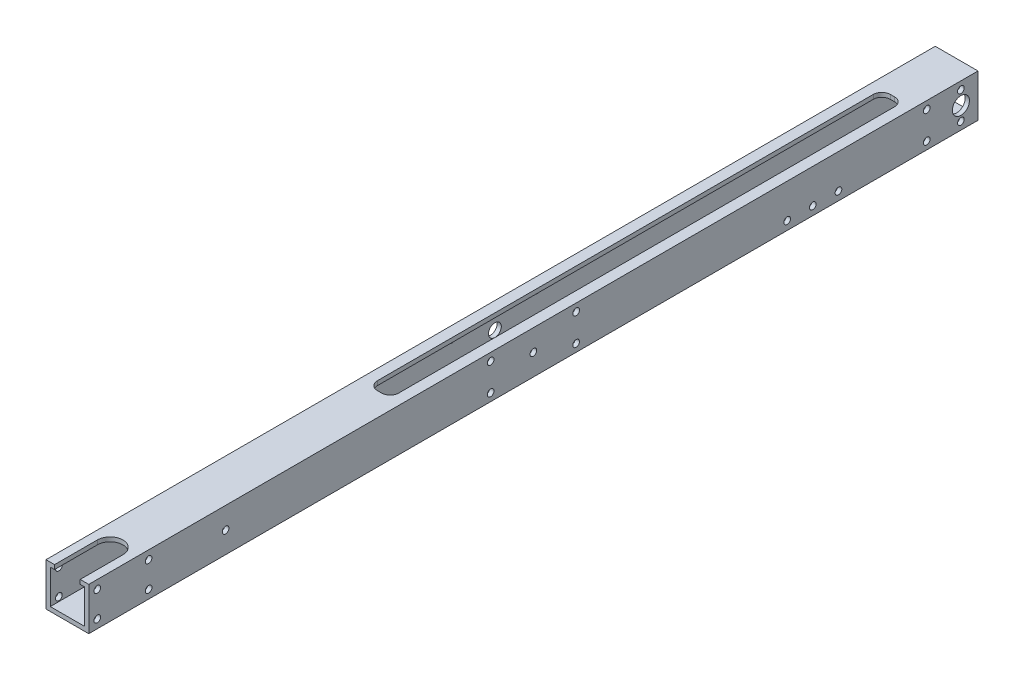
from build123d import *

# Parameters (mm, degrees)
SKETCH1_W           = 31.75
SKETCH1_H           = 31.75
SKETCH1_W_2         = 25.4
SKETCH1_H_2         = 25.4
BOSS_EXTRUDE1_DEPTH = 660.4
SKETCH2_R           = 2.4892
CUT_EXTRUDE1_DEPTH  = 662.353338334
SKETCH4_R           = 4.7625
CUT_EXTRUDE2_DEPTH  = 12.7
CUT_EXTRUDE3_REACH  = 663.353
SKETCH5_R           = 6.35
CUT_EXTRUDE4_REACH  = 663.353
SKETCH7_R           = 2.4892
CUT_EXTRUDE5_DEPTH  = 662.353338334
SKETCH8_R           = 2.4892
CUT_EXTRUDE6_DEPTH  = 662.353338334
SKETCH9_W           = 15.875
SKETCH9_H           = 381
CUT_EXTRUDE7_DEPTH  = 3.175
FILLET1_R           = 6.35


with BuildPart() as part:
    # Sketch1 → Boss-Extrude1 (new body)
    with BuildSketch(Plane.XY):
        Rectangle(SKETCH1_W, SKETCH1_H)
        Rectangle(SKETCH1_W_2, SKETCH1_H_2, mode=Mode.SUBTRACT)
    extrude(amount=BOSS_EXTRUDE1_DEPTH)

    # Sketch2 → Cut-Extrude1 (cut, through all)
    with BuildSketch(Plane(origin=(15.875, 0, 0), x_dir=(0, 0, -1), z_dir=(1, 0, 0))):
        with Locations(Location((-12.7, 0, 0), (0, 0, 90))):
            Circle(SKETCH2_R)
        with Locations(Location((-330.2, 0, 0), (0, 0, 90))):
            Circle(SKETCH2_R)
        with Locations(Location((-361.95, 10.16, 0), (0, 0, 90))):
            Circle(SKETCH2_R)
        with Locations(Location((-298.45, 10.16, 0), (0, 0, 90))):
            Circle(SKETCH2_R)
        with Locations(Location((-298.45, -10.16, 0), (0, 0, 90))):
            Circle(SKETCH2_R)
        with Locations(Location((-361.95, -10.16, 0), (0, 0, 90))):
            Circle(SKETCH2_R)
        with Locations(Location((-38.1, 10.16, 0), (0, 0, 90))):
            Circle(SKETCH2_R)
        with Locations(Location((-38.1, -10.16, 0), (0, 0, 90))):
            Circle(SKETCH2_R)
        with Locations(Location((-12.7, 10.16, 0), (0, 0, 90))):
            Circle(SKETCH2_R)
        with Locations(Location((-12.7, -10.16, 0), (0, 0, 90))):
            Circle(SKETCH2_R)
        with Locations(Location((-103.632, -9.525, 0), (0, 0, 90))):
            Circle(SKETCH2_R)
        with Locations(Location((-122.682, -9.525, 0), (0, 0, 90))):
            Circle(SKETCH2_R)
        with Locations(Location((-141.732, -9.525, 0), (0, 0, 90))):
            Circle(SKETCH2_R)
    extrude(amount=-CUT_EXTRUDE1_DEPTH, mode=Mode.SUBTRACT)

    # Sketch4 → Cut-Extrude2 (cut)
    with BuildSketch(Plane.ZY.offset(15.875)):
        with Locations(Location((330.2, 0, 0), (0, 0, 270))):
            Circle(SKETCH4_R)
    extrude(amount=-CUT_EXTRUDE2_DEPTH, mode=Mode.SUBTRACT)

    # Sketch5 → Cut-Extrude3 (cut, up to next)
    with BuildSketch(Plane(origin=(15.875, 0, 0), x_dir=(0, 0, -1), z_dir=(1, 0, 0)), mode=Mode.PRIVATE) as cut_extrude3_sk1:
        with Locations(Location((-12.7, 0, 0), (0, 0, 90))):
            Circle(SKETCH5_R)
    cut_extrude3_tool1 = extrude(cut_extrude3_sk1.sketch, amount=-CUT_EXTRUDE3_REACH, mode=Mode.PRIVATE) & part.part
    add(cut_extrude3_tool1.solids().sort_by_distance((15.875, 0, 12.7))[0], mode=Mode.SUBTRACT)

    # Sketch6 → Cut-Extrude4 (cut, up to next)
    with BuildSketch(Plane(origin=(0, 15.875, 0), x_dir=(1, 0, 0), z_dir=(0, 1, 0)), mode=Mode.PRIVATE) as cut_extrude4_sk1:
        with BuildLine():
            Line((-9.525, -660.4), (9.525, -660.4))
            Line((9.525, -660.4), (9.525, -628.65))
            ThreePointArc((9.525, -628.65), (0, -619.125), (-9.525, -628.65))
            Line((-9.525, -628.65), (-9.525, -660.4))
        make_face()
    cut_extrude4_tool1 = extrude(cut_extrude4_sk1.sketch, amount=-CUT_EXTRUDE4_REACH, mode=Mode.PRIVATE) & part.part
    add(cut_extrude4_tool1.solids().sort_by_distance((0, 15.875, 640.726938))[0], mode=Mode.SUBTRACT)

    # Sketch7 → Cut-Extrude5 (cut, through all)
    with BuildSketch(Plane.ZY.offset(15.875)):
        with Locations(Location((558.7746, 9e-09, 0), (0, 0, 270))):
            Circle(SKETCH7_R)
    extrude(amount=-CUT_EXTRUDE5_DEPTH, mode=Mode.SUBTRACT)

    # Sketch8 → Cut-Extrude6 (cut, through all)
    with BuildSketch(Plane(origin=(15.875, 0, 0), x_dir=(0, 0, -1), z_dir=(1, 0, 0))):
        with Locations(Location((-654.05, 9.525, 0), (0, 0, 90))):
            Circle(SKETCH8_R)
        with Locations(Location((-654.05, -9.525, 0), (0, 0, 90))):
            Circle(SKETCH8_R)
        with Locations(Location((-615.95, 9.525, 0), (0, 0, 90))):
            Circle(SKETCH8_R)
        with Locations(Location((-615.95, -9.525, 0), (0, 0, 90))):
            Circle(SKETCH8_R)
    extrude(amount=-CUT_EXTRUDE6_DEPTH, mode=Mode.SUBTRACT)

    # Sketch9 → Cut-Extrude7 (cut)
    with BuildSketch(Plane(origin=(0, 15.875, 0), x_dir=(1, 0, 0), z_dir=(0, 1, 0))):
        with Locations((0, -238.125)):
            Rectangle(SKETCH9_W, SKETCH9_H)
    extrude(amount=-CUT_EXTRUDE7_DEPTH, mode=Mode.SUBTRACT)

    # Fillet1
    fillet1_edges = [part.edges().sort_by_distance(p)[0] for p in [
        (7.9375, 14.2875, 47.625),
        (7.9375, 14.2875, 428.625),
        (-7.9375, 14.2875, 428.625),
        (-7.9375, 14.2875, 47.625),
    ]]
    fillet(fillet1_edges, radius=FILLET1_R)


solid = part.part
